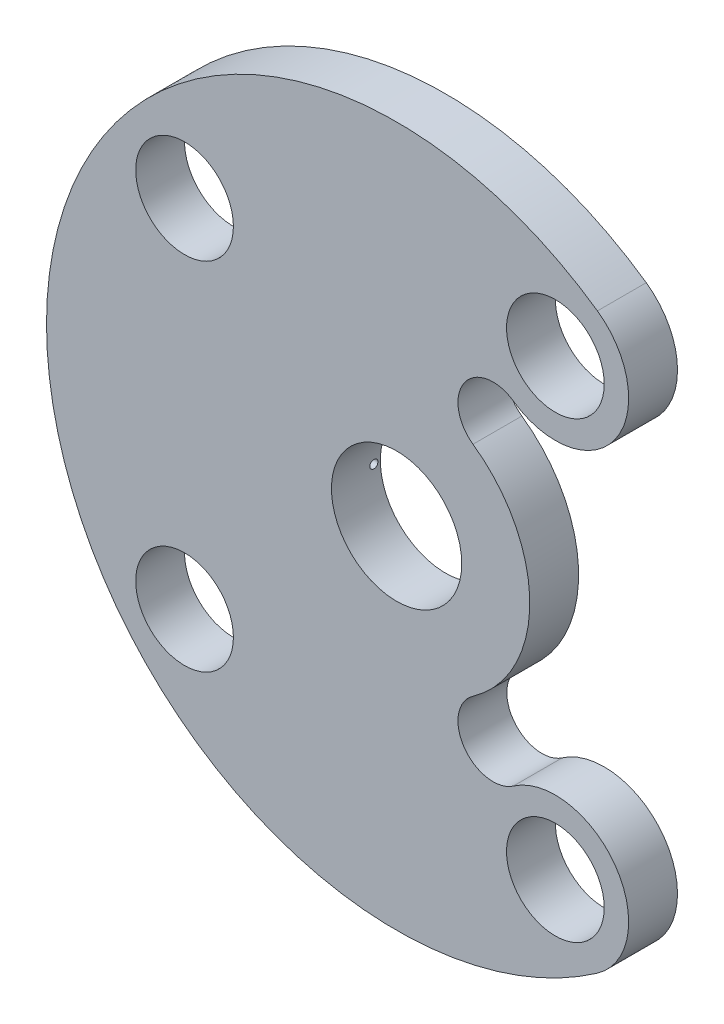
ISO-10303-21;
HEADER;
FILE_DESCRIPTION(('STEP AP214'),'2;1');
FILE_NAME('part.step','',(''),(''),'','','');
FILE_SCHEMA(('AUTOMOTIVE_DESIGN { 1 0 10303 214 1 1 1 1 }'));
ENDSEC;
DATA;
#1=APPLICATION_CONTEXT('core data for automotive mechanical design processes');
#2=APPLICATION_PROTOCOL_DEFINITION('international standard','automotive_design',2000,#1);
#3=PRODUCT_CONTEXT('',#1,'mechanical');
#4=PRODUCT('Part','Part','',(#3));
#5=PRODUCT_RELATED_PRODUCT_CATEGORY('part','',(#4));
#6=PRODUCT_DEFINITION_FORMATION('','',#4);
#7=PRODUCT_DEFINITION_CONTEXT('part definition',#1,'design');
#8=PRODUCT_DEFINITION('design','',#6,#7);
#9=PRODUCT_DEFINITION_SHAPE('','',#8);
#10=(LENGTH_UNIT() NAMED_UNIT(*) SI_UNIT(.MILLI.,.METRE.));
#11=(NAMED_UNIT(*) PLANE_ANGLE_UNIT() SI_UNIT($,.RADIAN.));
#12=(NAMED_UNIT(*) SI_UNIT($,.STERADIAN.) SOLID_ANGLE_UNIT());
#13=UNCERTAINTY_MEASURE_WITH_UNIT(LENGTH_MEASURE(1.E-05),#10,'distance_accuracy_value','');
#14=(GEOMETRIC_REPRESENTATION_CONTEXT(3) GLOBAL_UNCERTAINTY_ASSIGNED_CONTEXT((#13)) GLOBAL_UNIT_ASSIGNED_CONTEXT((#10,
#11,#12)) REPRESENTATION_CONTEXT('',''));
#15=CARTESIAN_POINT('',(0.,0.,0.));
#16=DIRECTION('',(0.,0.,1.));
#17=DIRECTION('',(1.,0.,0.));
#18=AXIS2_PLACEMENT_3D('',#15,#16,#17);
#19=CARTESIAN_POINT('',(9.7507994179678,-13.9255847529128,58.9206550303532));
#20=DIRECTION('',(0.,0.,-1.));
#21=DIRECTION('',(-1.,0.,0.));
#22=AXIS2_PLACEMENT_3D('',#19,#20,#21);
#23=CYLINDRICAL_SURFACE('',#22,3.);
#24=CARTESIAN_POINT('',(9.7507994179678,-13.9255847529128,0.));
#25=DIRECTION('',(0.,0.,1.));
#26=DIRECTION('',(1.,0.,0.));
#27=AXIS2_PLACEMENT_3D('',#24,#25,#26);
#28=CIRCLE('',#27,3.);
#29=CARTESIAN_POINT('',(12.7507994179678,-13.9255847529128,0.));
#30=VERTEX_POINT('',#29);
#31=EDGE_CURVE('E980',#30,#30,#28,.T.);
#32=ORIENTED_EDGE('',*,*,#31,.F.);
#33=EDGE_LOOP('',(#32));
#34=FACE_BOUND('',#33,.T.);
#35=CARTESIAN_POINT('',(9.7507994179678,-13.9255847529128,3.));
#36=DIRECTION('',(0.,0.,1.));
#37=DIRECTION('',(1.,0.,0.));
#38=AXIS2_PLACEMENT_3D('',#35,#36,#37);
#39=CIRCLE('',#38,3.);
#40=CARTESIAN_POINT('',(12.7507994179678,-13.9255847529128,3.));
#41=VERTEX_POINT('',#40);
#42=EDGE_CURVE('E947',#41,#41,#39,.T.);
#43=ORIENTED_EDGE('',*,*,#42,.T.);
#44=EDGE_LOOP('',(#43));
#45=FACE_BOUND('',#44,.T.);
#46=ADVANCED_FACE('F866',(#34,#45),#23,.F.);
#47=CARTESIAN_POINT('',(0.,0.,58.9206550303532));
#48=DIRECTION('',(0.,0.,-1.));
#49=DIRECTION('',(-1.,0.,0.));
#50=AXIS2_PLACEMENT_3D('',#47,#48,#49);
#51=CYLINDRICAL_SURFACE('',#50,4.);
#52=CARTESIAN_POINT('',(-4.,0.,0.647096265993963));
#53=CARTESIAN_POINT('',(-3.99999989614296,-0.0140279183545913,0.647095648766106));
#54=CARTESIAN_POINT('',(-3.99992541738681,-0.0280656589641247,0.645911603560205));
#55=CARTESIAN_POINT('',(-3.99963546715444,-0.0557535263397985,0.641205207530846));
#56=CARTESIAN_POINT('',(-3.99941983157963,-0.0694031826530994,0.637680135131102));
#57=CARTESIAN_POINT('',(-3.99887196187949,-0.0959098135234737,0.628393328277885));
#58=CARTESIAN_POINT('',(-3.99853978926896,-0.10876720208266,0.622632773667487));
#59=CARTESIAN_POINT('',(-3.99779620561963,-0.133329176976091,0.60904043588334));
#60=CARTESIAN_POINT('',(-3.99738481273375,-0.145034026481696,0.601209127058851));
#61=CARTESIAN_POINT('',(-3.99652834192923,-0.166979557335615,0.583684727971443));
#62=CARTESIAN_POINT('',(-3.99608322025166,-0.177218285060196,0.573989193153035));
#63=CARTESIAN_POINT('',(-3.99520983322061,-0.195924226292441,0.553016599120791));
#64=CARTESIAN_POINT('',(-3.99478156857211,-0.204391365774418,0.541739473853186));
#65=CARTESIAN_POINT('',(-3.99398985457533,-0.219319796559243,0.517912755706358));
#66=CARTESIAN_POINT('',(-3.99362645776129,-0.225779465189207,0.505362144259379));
#67=CARTESIAN_POINT('',(-3.99300602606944,-0.236499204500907,0.479351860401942));
#68=CARTESIAN_POINT('',(-3.99274899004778,-0.24075929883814,0.465892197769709));
#69=CARTESIAN_POINT('',(-3.99237068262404,-0.246953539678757,0.438464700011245));
#70=CARTESIAN_POINT('',(-3.9922492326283,-0.248890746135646,0.424497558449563));
#71=CARTESIAN_POINT('',(-3.99215525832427,-0.250393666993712,0.396435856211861));
#72=CARTESIAN_POINT('',(-3.99218273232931,-0.24995940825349,0.382341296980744));
#73=CARTESIAN_POINT('',(-3.9923833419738,-0.246734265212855,0.35444570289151));
#74=CARTESIAN_POINT('',(-3.9925562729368,-0.243946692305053,0.340644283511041));
#75=CARTESIAN_POINT('',(-3.99302798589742,-0.236099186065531,0.313705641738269));
#76=CARTESIAN_POINT('',(-3.9933267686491,-0.231039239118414,0.300568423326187));
#77=CARTESIAN_POINT('',(-3.99401674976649,-0.218786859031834,0.275320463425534));
#78=CARTESIAN_POINT('',(-3.99440801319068,-0.211592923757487,0.263210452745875));
#79=CARTESIAN_POINT('',(-3.99523879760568,-0.195277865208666,0.240368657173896));
#80=CARTESIAN_POINT('',(-3.99567831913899,-0.18615672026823,0.22963688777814));
#81=CARTESIAN_POINT('',(-3.99655699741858,-0.166227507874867,0.209836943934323));
#82=CARTESIAN_POINT('',(-3.99699615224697,-0.155416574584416,0.200771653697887));
#83=CARTESIAN_POINT('',(-3.99782388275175,-0.132424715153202,0.184584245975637));
#84=CARTESIAN_POINT('',(-3.99821245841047,-0.120243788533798,0.177462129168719));
#85=CARTESIAN_POINT('',(-3.99889527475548,-0.0948559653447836,0.165363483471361));
#86=CARTESIAN_POINT('',(-3.99918951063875,-0.0816490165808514,0.160387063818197));
#87=CARTESIAN_POINT('',(-3.99965042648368,-0.05458482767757,0.152723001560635));
#88=CARTESIAN_POINT('',(-3.99981710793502,-0.0407275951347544,0.15003533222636));
#89=CARTESIAN_POINT('',(-4.00000394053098,-0.0127812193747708,0.147028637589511));
#90=CARTESIAN_POINT('',(-4.00002433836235,0.00130749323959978,0.146705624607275));
#91=CARTESIAN_POINT('',(-3.9999169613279,0.029338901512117,0.148426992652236));
#92=CARTESIAN_POINT('',(-3.99978918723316,0.043281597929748,0.150471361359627));
#93=CARTESIAN_POINT('',(-3.9994000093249,0.0706139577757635,0.156866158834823));
#94=CARTESIAN_POINT('',(-3.99913871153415,0.0840040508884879,0.161214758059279));
#95=CARTESIAN_POINT('',(-3.9985118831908,0.109864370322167,0.172092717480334));
#96=CARTESIAN_POINT('',(-3.99814635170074,0.122334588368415,0.178622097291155));
#97=CARTESIAN_POINT('',(-3.99735151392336,0.146019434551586,0.193686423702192));
#98=CARTESIAN_POINT('',(-3.99692212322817,0.15723236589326,0.202224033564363));
#99=CARTESIAN_POINT('',(-3.99604817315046,0.178067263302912,0.221058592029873));
#100=CARTESIAN_POINT('',(-3.99560361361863,0.187689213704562,0.231355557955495));
#101=CARTESIAN_POINT('',(-3.99474871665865,0.205082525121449,0.25343373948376));
#102=CARTESIAN_POINT('',(-3.99433842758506,0.212851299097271,0.265216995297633));
#103=CARTESIAN_POINT('',(-3.99359911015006,0.226300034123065,0.289923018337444));
#104=CARTESIAN_POINT('',(-3.99327008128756,0.231980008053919,0.302845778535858));
#105=CARTESIAN_POINT('',(-3.99273073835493,0.241085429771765,0.329454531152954));
#106=CARTESIAN_POINT('',(-3.99252033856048,0.244512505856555,0.343139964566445));
#107=CARTESIAN_POINT('',(-3.99224174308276,0.249020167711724,0.370893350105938));
#108=CARTESIAN_POINT('',(-3.99217354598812,0.250100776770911,0.384961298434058));
#109=CARTESIAN_POINT('',(-3.99218708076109,0.249884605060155,0.413054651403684));
#110=CARTESIAN_POINT('',(-3.99226855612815,0.248591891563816,0.427080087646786));
#111=CARTESIAN_POINT('',(-3.99257171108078,0.243674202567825,0.454714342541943));
#112=CARTESIAN_POINT('',(-3.99279339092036,0.24004922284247,0.468323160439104));
#113=CARTESIAN_POINT('',(-3.99335191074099,0.230570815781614,0.494738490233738));
#114=CARTESIAN_POINT('',(-3.99368874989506,0.224717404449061,0.507545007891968));
#115=CARTESIAN_POINT('',(-3.99443962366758,0.210948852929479,0.531994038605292));
#116=CARTESIAN_POINT('',(-3.99485365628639,0.203033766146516,0.543636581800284));
#117=CARTESIAN_POINT('',(-3.99571308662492,0.185351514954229,0.565447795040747));
#118=CARTESIAN_POINT('',(-3.99615853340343,0.175581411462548,0.575614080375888));
#119=CARTESIAN_POINT('',(-3.997030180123,0.154470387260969,0.594165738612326));
#120=CARTESIAN_POINT('',(-3.99745637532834,0.143129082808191,0.602550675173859));
#121=CARTESIAN_POINT('',(-3.99824193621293,0.119184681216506,0.617307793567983));
#122=CARTESIAN_POINT('',(-3.99860121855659,0.106580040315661,0.623677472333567));
#123=CARTESIAN_POINT('',(-3.9992113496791,0.0804871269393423,0.634202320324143));
#124=CARTESIAN_POINT('',(-3.99946232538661,0.0669999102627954,0.63836008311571));
#125=CARTESIAN_POINT('',(-3.99976179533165,0.0445251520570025,0.643262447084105));
#126=CARTESIAN_POINT('',(-3.99985072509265,0.0356828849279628,0.644698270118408));
#127=CARTESIAN_POINT('',(-3.99996986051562,0.0178950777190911,0.646615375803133));
#128=CARTESIAN_POINT('',(-4.00000006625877,0.00894953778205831,0.647096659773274));
#129=CARTESIAN_POINT('',(-4.,0.,0.647096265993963));
#130=B_SPLINE_CURVE_WITH_KNOTS('',3,(#52,#53,#54,#55,#56,#57,#58,#59,#60,#61,#62,#63,#64,#65,
#66,#67,#68,#69,#70,#71,#72,#73,#74,#75,#76,#77,#78,#79,#80,#81,#82,#83,#84,#85,#86,#87,#88,#89,
#90,#91,#92,#93,#94,#95,#96,#97,#98,#99,#100,#101,#102,#103,#104,#105,#106,#107,#108,#109,#110,
#111,#112,#113,#114,#115,#116,#117,#118,#119,#120,#121,#122,#123,#124,#125,#126,#127,#128,#129),
.UNSPECIFIED.,.T.,.F.,(4,2,2,2,2,2,2,2,2,2,2,2,2,2,2,2,2,2,2,2,2,2,2,2,2,2,2,2,2,2,2,2,2,2,2,2,
2,2,4),(0.,0.0420510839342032,0.0841511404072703,0.12622900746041,0.168297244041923,
0.210421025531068,0.252546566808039,0.294706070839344,0.336865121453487,0.378968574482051,
0.42107155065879,0.463115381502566,0.505159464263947,0.547233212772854,0.589307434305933,
0.631453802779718,0.673600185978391,0.715748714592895,0.757896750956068,0.79997369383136,
0.842050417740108,0.884093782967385,0.926137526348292,0.968237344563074,1.01033757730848,
1.05249624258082,1.09465464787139,1.13678254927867,1.17891003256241,1.22096538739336,
1.2630208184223,1.30507594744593,1.34712998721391,1.38925122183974,1.43138276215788,
1.47356642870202,1.51570052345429,1.54252833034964,1.56935610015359),.UNSPECIFIED.);
#131=CARTESIAN_POINT('',(-4.,0.,0.647096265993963));
#132=VERTEX_POINT('',#131);
#133=EDGE_CURVE('E931',#132,#132,#130,.T.);
#134=ORIENTED_EDGE('',*,*,#133,.F.);
#135=EDGE_LOOP('',(#134));
#136=FACE_BOUND('',#135,.T.);
#137=CARTESIAN_POINT('',(0.,0.,0.));
#138=DIRECTION('',(0.,0.,1.));
#139=DIRECTION('',(1.,0.,0.));
#140=AXIS2_PLACEMENT_3D('',#137,#138,#139);
#141=CIRCLE('',#140,4.);
#142=CARTESIAN_POINT('',(4.,0.,0.));
#143=VERTEX_POINT('',#142);
#144=EDGE_CURVE('E986',#143,#143,#141,.T.);
#145=ORIENTED_EDGE('',*,*,#144,.F.);
#146=EDGE_LOOP('',(#145));
#147=FACE_BOUND('',#146,.T.);
#148=CARTESIAN_POINT('',(0.,0.,3.));
#149=DIRECTION('',(0.,0.,1.));
#150=DIRECTION('',(1.,0.,0.));
#151=AXIS2_PLACEMENT_3D('',#148,#149,#150);
#152=CIRCLE('',#151,4.);
#153=CARTESIAN_POINT('',(4.,0.,3.));
#154=VERTEX_POINT('',#153);
#155=EDGE_CURVE('E953',#154,#154,#152,.T.);
#156=ORIENTED_EDGE('',*,*,#155,.T.);
#157=EDGE_LOOP('',(#156));
#158=FACE_BOUND('',#157,.T.);
#159=ADVANCED_FACE('F1055',(#136,#147,#158),#51,.F.);
#160=CARTESIAN_POINT('',(9.7507994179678,-13.9255847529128,58.9206550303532));
#161=DIRECTION('',(0.,0.,-1.));
#162=DIRECTION('',(-1.,0.,0.));
#163=AXIS2_PLACEMENT_3D('',#160,#161,#162);
#164=CYLINDRICAL_SURFACE('',#163,4.5);
#165=CARTESIAN_POINT('',(9.7507994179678,-13.9255847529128,3.));
#166=DIRECTION('',(0.,0.,1.));
#167=DIRECTION('',(1.,0.,0.));
#168=AXIS2_PLACEMENT_3D('',#165,#166,#167);
#169=CIRCLE('',#168,4.5);
#170=CARTESIAN_POINT('',(12.3318933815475,-17.6117689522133,3.));
#171=VERTEX_POINT('',#170);
#172=CARTESIAN_POINT('',(7.16970545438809,-10.2394005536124,3.));
#173=VERTEX_POINT('',#172);
#174=EDGE_CURVE('E956',#171,#173,#169,.T.);
#175=ORIENTED_EDGE('',*,*,#174,.F.);
#176=DIRECTION('',(0.,0.,-1.));
#177=VECTOR('',#176,1.);
#178=CARTESIAN_POINT('',(12.3318933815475,-17.6117689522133,58.9206550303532));
#179=LINE('',#178,#177);
#180=CARTESIAN_POINT('',(12.3318933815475,-17.6117689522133,0.));
#181=VERTEX_POINT('',#180);
#182=EDGE_CURVE('E888',#171,#181,#179,.T.);
#183=ORIENTED_EDGE('',*,*,#182,.T.);
#184=CARTESIAN_POINT('',(9.7507994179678,-13.9255847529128,0.));
#185=DIRECTION('',(0.,0.,1.));
#186=DIRECTION('',(1.,0.,0.));
#187=AXIS2_PLACEMENT_3D('',#184,#185,#186);
#188=CIRCLE('',#187,4.5);
#189=CARTESIAN_POINT('',(7.16970545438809,-10.2394005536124,0.));
#190=VERTEX_POINT('',#189);
#191=EDGE_CURVE('E1003',#181,#190,#188,.T.);
#192=ORIENTED_EDGE('',*,*,#191,.T.);
#193=DIRECTION('',(0.,0.,-1.));
#194=VECTOR('',#193,1.);
#195=CARTESIAN_POINT('',(7.16970545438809,-10.2394005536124,58.9206550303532));
#196=LINE('',#195,#194);
#197=EDGE_CURVE('E1006',#173,#190,#196,.T.);
#198=ORIENTED_EDGE('',*,*,#197,.F.);
#199=EDGE_LOOP('',(#175,#183,#192,#198));
#200=FACE_BOUND('',#199,.T.);
#201=ADVANCED_FACE('F1029',(#200),#164,.T.);
#202=CARTESIAN_POINT('',(0.,0.,58.9206550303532));
#203=DIRECTION('',(0.,0.,-1.));
#204=DIRECTION('',(-1.,0.,0.));
#205=AXIS2_PLACEMENT_3D('',#202,#203,#204);
#206=CYLINDRICAL_SURFACE('',#205,21.5);
#207=CARTESIAN_POINT('',(0.,0.,3.));
#208=DIRECTION('',(0.,0.,1.));
#209=DIRECTION('',(1.,0.,0.));
#210=AXIS2_PLACEMENT_3D('',#207,#208,#209);
#211=CIRCLE('',#210,21.5);
#212=CARTESIAN_POINT('',(12.3318933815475,17.6117689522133,3.));
#213=VERTEX_POINT('',#212);
#214=EDGE_CURVE('E959',#213,#171,#211,.T.);
#215=ORIENTED_EDGE('',*,*,#214,.F.);
#216=DIRECTION('',(0.,0.,-1.));
#217=VECTOR('',#216,1.);
#218=CARTESIAN_POINT('',(12.3318933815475,17.6117689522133,58.9206550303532));
#219=LINE('',#218,#217);
#220=CARTESIAN_POINT('',(12.3318933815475,17.6117689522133,0.));
#221=VERTEX_POINT('',#220);
#222=EDGE_CURVE('E1009',#213,#221,#219,.T.);
#223=ORIENTED_EDGE('',*,*,#222,.T.);
#224=CARTESIAN_POINT('',(0.,0.,0.));
#225=DIRECTION('',(0.,0.,1.));
#226=DIRECTION('',(1.,0.,0.));
#227=AXIS2_PLACEMENT_3D('',#224,#225,#226);
#228=CIRCLE('',#227,21.5);
#229=EDGE_CURVE('E1001',#221,#181,#228,.T.);
#230=ORIENTED_EDGE('',*,*,#229,.T.);
#231=ORIENTED_EDGE('',*,*,#182,.F.);
#232=EDGE_LOOP('',(#215,#223,#230,#231));
#233=FACE_BOUND('',#232,.T.);
#234=ADVANCED_FACE('F1031',(#233),#206,.T.);
#235=CARTESIAN_POINT('',(9.7507994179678,13.9255847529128,58.9206550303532));
#236=DIRECTION('',(0.,0.,-1.));
#237=DIRECTION('',(-1.,0.,0.));
#238=AXIS2_PLACEMENT_3D('',#235,#236,#237);
#239=CYLINDRICAL_SURFACE('',#238,4.5);
#240=CARTESIAN_POINT('',(9.7507994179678,13.9255847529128,3.));
#241=DIRECTION('',(0.,0.,1.));
#242=DIRECTION('',(1.,0.,0.));
#243=AXIS2_PLACEMENT_3D('',#240,#241,#242);
#244=CIRCLE('',#243,4.5);
#245=CARTESIAN_POINT('',(7.16970545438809,10.2394005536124,3.));
#246=VERTEX_POINT('',#245);
#247=EDGE_CURVE('E962',#246,#213,#244,.T.);
#248=ORIENTED_EDGE('',*,*,#247,.F.);
#249=DIRECTION('',(0.,0.,-1.));
#250=VECTOR('',#249,1.);
#251=CARTESIAN_POINT('',(7.16970545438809,10.2394005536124,58.9206550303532));
#252=LINE('',#251,#250);
#253=CARTESIAN_POINT('',(7.16970545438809,10.2394005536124,0.));
#254=VERTEX_POINT('',#253);
#255=EDGE_CURVE('E1011',#246,#254,#252,.T.);
#256=ORIENTED_EDGE('',*,*,#255,.T.);
#257=CARTESIAN_POINT('',(9.7507994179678,13.9255847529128,0.));
#258=DIRECTION('',(0.,0.,1.));
#259=DIRECTION('',(1.,0.,0.));
#260=AXIS2_PLACEMENT_3D('',#257,#258,#259);
#261=CIRCLE('',#260,4.5);
#262=EDGE_CURVE('E998',#254,#221,#261,.T.);
#263=ORIENTED_EDGE('',*,*,#262,.T.);
#264=ORIENTED_EDGE('',*,*,#222,.F.);
#265=EDGE_LOOP('',(#248,#256,#263,#264));
#266=FACE_BOUND('',#265,.T.);
#267=ADVANCED_FACE('F1034',(#266),#239,.T.);
#268=CARTESIAN_POINT('',(5.93043012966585,8.46953196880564,58.9206550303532));
#269=DIRECTION('',(0.,0.,-1.));
#270=DIRECTION('',(-1.,0.,0.));
#271=AXIS2_PLACEMENT_3D('',#268,#269,#270);
#272=CYLINDRICAL_SURFACE('',#271,2.16061059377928);
#273=CARTESIAN_POINT('',(5.93043012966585,8.46953196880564,3.));
#274=DIRECTION('',(0.,0.,1.));
#275=DIRECTION('',(1.,0.,0.));
#276=AXIS2_PLACEMENT_3D('',#273,#274,#275);
#277=CIRCLE('',#276,2.16061059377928);
#278=CARTESIAN_POINT('',(4.69115480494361,6.69966338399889,3.));
#279=VERTEX_POINT('',#278);
#280=EDGE_CURVE('E965',#279,#246,#277,.F.);
#281=ORIENTED_EDGE('',*,*,#280,.F.);
#282=DIRECTION('',(0.,0.,-1.));
#283=VECTOR('',#282,1.);
#284=CARTESIAN_POINT('',(4.69115480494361,6.69966338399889,58.9206550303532));
#285=LINE('',#284,#283);
#286=CARTESIAN_POINT('',(4.69115480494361,6.69966338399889,0.));
#287=VERTEX_POINT('',#286);
#288=EDGE_CURVE('E1013',#279,#287,#285,.T.);
#289=ORIENTED_EDGE('',*,*,#288,.T.);
#290=CARTESIAN_POINT('',(5.93043012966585,8.46953196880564,0.));
#291=DIRECTION('',(0.,0.,-1.));
#292=DIRECTION('',(-1.,0.,0.));
#293=AXIS2_PLACEMENT_3D('',#290,#291,#292);
#294=CIRCLE('',#293,2.16061059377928);
#295=EDGE_CURVE('E995',#287,#254,#294,.T.);
#296=ORIENTED_EDGE('',*,*,#295,.T.);
#297=ORIENTED_EDGE('',*,*,#255,.F.);
#298=EDGE_LOOP('',(#281,#289,#296,#297));
#299=FACE_BOUND('',#298,.T.);
#300=ADVANCED_FACE('F1037',(#299),#272,.F.);
#301=CARTESIAN_POINT('',(0.,0.,58.9206550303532));
#302=DIRECTION('',(0.,0.,-1.));
#303=DIRECTION('',(-1.,0.,0.));
#304=AXIS2_PLACEMENT_3D('',#301,#302,#303);
#305=CYLINDRICAL_SURFACE('',#304,8.17877881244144);
#306=CARTESIAN_POINT('',(0.,0.,3.));
#307=DIRECTION('',(0.,0.,1.));
#308=DIRECTION('',(1.,0.,0.));
#309=AXIS2_PLACEMENT_3D('',#306,#307,#308);
#310=CIRCLE('',#309,8.17877881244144);
#311=CARTESIAN_POINT('',(4.69115480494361,-6.69966338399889,3.));
#312=VERTEX_POINT('',#311);
#313=EDGE_CURVE('E968',#312,#279,#310,.T.);
#314=ORIENTED_EDGE('',*,*,#313,.F.);
#315=DIRECTION('',(0.,0.,-1.));
#316=VECTOR('',#315,1.);
#317=CARTESIAN_POINT('',(4.69115480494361,-6.69966338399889,58.9206550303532));
#318=LINE('',#317,#316);
#319=CARTESIAN_POINT('',(4.69115480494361,-6.69966338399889,0.));
#320=VERTEX_POINT('',#319);
#321=EDGE_CURVE('E928',#312,#320,#318,.T.);
#322=ORIENTED_EDGE('',*,*,#321,.T.);
#323=CARTESIAN_POINT('',(0.,0.,0.));
#324=DIRECTION('',(0.,0.,1.));
#325=DIRECTION('',(1.,0.,0.));
#326=AXIS2_PLACEMENT_3D('',#323,#324,#325);
#327=CIRCLE('',#326,8.17877881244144);
#328=EDGE_CURVE('E992',#320,#287,#327,.T.);
#329=ORIENTED_EDGE('',*,*,#328,.T.);
#330=ORIENTED_EDGE('',*,*,#288,.F.);
#331=EDGE_LOOP('',(#314,#322,#329,#330));
#332=FACE_BOUND('',#331,.T.);
#333=ADVANCED_FACE('F1018',(#332),#305,.T.);
#334=CARTESIAN_POINT('',(5.93043012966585,-8.46953196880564,58.9206550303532));
#335=DIRECTION('',(0.,0.,-1.));
#336=DIRECTION('',(-1.,0.,0.));
#337=AXIS2_PLACEMENT_3D('',#334,#335,#336);
#338=CYLINDRICAL_SURFACE('',#337,2.16061059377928);
#339=CARTESIAN_POINT('',(5.93043012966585,-8.46953196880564,3.));
#340=DIRECTION('',(0.,0.,1.));
#341=DIRECTION('',(1.,0.,0.));
#342=AXIS2_PLACEMENT_3D('',#339,#340,#341);
#343=CIRCLE('',#342,2.16061059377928);
#344=EDGE_CURVE('E971',#173,#312,#343,.F.);
#345=ORIENTED_EDGE('',*,*,#344,.F.);
#346=ORIENTED_EDGE('',*,*,#197,.T.);
#347=CARTESIAN_POINT('',(5.93043012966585,-8.46953196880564,0.));
#348=DIRECTION('',(0.,0.,-1.));
#349=DIRECTION('',(1.,0.,0.));
#350=AXIS2_PLACEMENT_3D('',#347,#348,#349);
#351=CIRCLE('',#350,2.16061059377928);
#352=EDGE_CURVE('E989',#190,#320,#351,.T.);
#353=ORIENTED_EDGE('',*,*,#352,.T.);
#354=ORIENTED_EDGE('',*,*,#321,.F.);
#355=EDGE_LOOP('',(#345,#346,#353,#354));
#356=FACE_BOUND('',#355,.T.);
#357=ADVANCED_FACE('F868',(#356),#338,.F.);
#358=CARTESIAN_POINT('',(-13.0227555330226,-10.9273893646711,58.9206550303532));
#359=DIRECTION('',(0.,0.,-1.));
#360=DIRECTION('',(-1.,0.,0.));
#361=AXIS2_PLACEMENT_3D('',#358,#359,#360);
#362=CYLINDRICAL_SURFACE('',#361,3.);
#363=CARTESIAN_POINT('',(-13.0227555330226,-10.9273893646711,0.));
#364=DIRECTION('',(0.,0.,1.));
#365=DIRECTION('',(1.,0.,0.));
#366=AXIS2_PLACEMENT_3D('',#363,#364,#365);
#367=CIRCLE('',#366,3.);
#368=CARTESIAN_POINT('',(-10.0227555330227,-10.9273893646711,0.));
#369=VERTEX_POINT('',#368);
#370=EDGE_CURVE('E983',#369,#369,#367,.T.);
#371=ORIENTED_EDGE('',*,*,#370,.F.);
#372=EDGE_LOOP('',(#371));
#373=FACE_BOUND('',#372,.T.);
#374=CARTESIAN_POINT('',(-13.0227555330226,-10.9273893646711,3.));
#375=DIRECTION('',(0.,0.,1.));
#376=DIRECTION('',(1.,0.,0.));
#377=AXIS2_PLACEMENT_3D('',#374,#375,#376);
#378=CIRCLE('',#377,3.);
#379=CARTESIAN_POINT('',(-10.0227555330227,-10.9273893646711,3.));
#380=VERTEX_POINT('',#379);
#381=EDGE_CURVE('E950',#380,#380,#378,.T.);
#382=ORIENTED_EDGE('',*,*,#381,.T.);
#383=EDGE_LOOP('',(#382));
#384=FACE_BOUND('',#383,.T.);
#385=ADVANCED_FACE('F1068',(#373,#384),#362,.F.);
#386=CARTESIAN_POINT('',(-13.0227555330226,10.9273893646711,58.9206550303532));
#387=DIRECTION('',(0.,0.,-1.));
#388=DIRECTION('',(-1.,0.,0.));
#389=AXIS2_PLACEMENT_3D('',#386,#387,#388);
#390=CYLINDRICAL_SURFACE('',#389,3.);
#391=CARTESIAN_POINT('',(-13.0227555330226,10.9273893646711,0.));
#392=DIRECTION('',(0.,0.,1.));
#393=DIRECTION('',(1.,0.,0.));
#394=AXIS2_PLACEMENT_3D('',#391,#392,#393);
#395=CIRCLE('',#394,3.);
#396=CARTESIAN_POINT('',(-10.0227555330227,10.9273893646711,0.));
#397=VERTEX_POINT('',#396);
#398=EDGE_CURVE('E977',#397,#397,#395,.T.);
#399=ORIENTED_EDGE('',*,*,#398,.F.);
#400=EDGE_LOOP('',(#399));
#401=FACE_BOUND('',#400,.T.);
#402=CARTESIAN_POINT('',(-13.0227555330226,10.9273893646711,3.));
#403=DIRECTION('',(0.,0.,1.));
#404=DIRECTION('',(1.,0.,0.));
#405=AXIS2_PLACEMENT_3D('',#402,#403,#404);
#406=CIRCLE('',#405,3.);
#407=CARTESIAN_POINT('',(-10.0227555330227,10.9273893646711,3.));
#408=VERTEX_POINT('',#407);
#409=EDGE_CURVE('E934',#408,#408,#406,.T.);
#410=ORIENTED_EDGE('',*,*,#409,.T.);
#411=EDGE_LOOP('',(#410));
#412=FACE_BOUND('',#411,.T.);
#413=ADVANCED_FACE('F1067',(#401,#412),#390,.F.);
#414=CARTESIAN_POINT('',(7.84061477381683,-11.1975583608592,0.));
#415=DIRECTION('',(0.,0.,1.));
#416=DIRECTION('',(1.,0.,0.));
#417=AXIS2_PLACEMENT_3D('',#414,#415,#416);
#418=PLANE('',#417);
#419=CARTESIAN_POINT('',(-6.00000000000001,0.,0.));
#420=DIRECTION('',(0.,0.,1.));
#421=DIRECTION('',(-1.,0.,0.));
#422=AXIS2_PLACEMENT_3D('',#419,#420,#421);
#423=ELLIPSE('',#422,8.02275553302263,0.977727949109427);
#424=CARTESIAN_POINT('',(-6.,0.977727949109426,0.));
#425=VERTEX_POINT('',#424);
#426=CARTESIAN_POINT('',(-6.,-0.977727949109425,0.));
#427=VERTEX_POINT('',#426);
#428=EDGE_CURVE('E12',#425,#427,#423,.T.);
#429=ORIENTED_EDGE('',*,*,#428,.T.);
#430=DIRECTION('',(0.,1.,0.));
#431=VECTOR('',#430,1.);
#432=CARTESIAN_POINT('',(-6.,-11.1975583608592,0.));
#433=LINE('',#432,#431);
#434=EDGE_CURVE('E874',#427,#425,#433,.T.);
#435=ORIENTED_EDGE('',*,*,#434,.T.);
#436=EDGE_LOOP('',(#429,#435));
#437=FACE_BOUND('',#436,.T.);
#438=ORIENTED_EDGE('',*,*,#398,.T.);
#439=EDGE_LOOP('',(#438));
#440=FACE_BOUND('',#439,.T.);
#441=ORIENTED_EDGE('',*,*,#370,.T.);
#442=EDGE_LOOP('',(#441));
#443=FACE_BOUND('',#442,.T.);
#444=ORIENTED_EDGE('',*,*,#352,.F.);
#445=ORIENTED_EDGE('',*,*,#191,.F.);
#446=ORIENTED_EDGE('',*,*,#229,.F.);
#447=ORIENTED_EDGE('',*,*,#262,.F.);
#448=ORIENTED_EDGE('',*,*,#295,.F.);
#449=ORIENTED_EDGE('',*,*,#328,.F.);
#450=EDGE_LOOP('',(#444,#445,#446,#447,#448,#449));
#451=FACE_BOUND('',#450,.T.);
#452=ORIENTED_EDGE('',*,*,#144,.T.);
#453=EDGE_LOOP('',(#452));
#454=FACE_BOUND('',#453,.T.);
#455=ORIENTED_EDGE('',*,*,#31,.T.);
#456=EDGE_LOOP('',(#455));
#457=FACE_BOUND('',#456,.T.);
#458=CARTESIAN_POINT('',(9.7507994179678,13.9255847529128,0.));
#459=DIRECTION('',(0.,0.,1.));
#460=DIRECTION('',(1.,0.,0.));
#461=AXIS2_PLACEMENT_3D('',#458,#459,#460);
#462=CIRCLE('',#461,3.);
#463=CARTESIAN_POINT('',(12.7507994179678,13.9255847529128,0.));
#464=VERTEX_POINT('',#463);
#465=EDGE_CURVE('E974',#464,#464,#462,.T.);
#466=ORIENTED_EDGE('',*,*,#465,.T.);
#467=EDGE_LOOP('',(#466));
#468=FACE_BOUND('',#467,.T.);
#469=ADVANCED_FACE('F924',(#437,#440,#443,#451,#454,#457,#468),#418,.F.);
#470=CARTESIAN_POINT('',(9.7507994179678,13.9255847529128,58.9206550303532));
#471=DIRECTION('',(0.,0.,-1.));
#472=DIRECTION('',(-1.,0.,0.));
#473=AXIS2_PLACEMENT_3D('',#470,#471,#472);
#474=CYLINDRICAL_SURFACE('',#473,3.);
#475=ORIENTED_EDGE('',*,*,#465,.F.);
#476=EDGE_LOOP('',(#475));
#477=FACE_BOUND('',#476,.T.);
#478=CARTESIAN_POINT('',(9.7507994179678,13.9255847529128,3.));
#479=DIRECTION('',(0.,0.,1.));
#480=DIRECTION('',(1.,0.,0.));
#481=AXIS2_PLACEMENT_3D('',#478,#479,#480);
#482=CIRCLE('',#481,3.);
#483=CARTESIAN_POINT('',(12.7507994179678,13.9255847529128,3.));
#484=VERTEX_POINT('',#483);
#485=EDGE_CURVE('E930',#484,#484,#482,.T.);
#486=ORIENTED_EDGE('',*,*,#485,.T.);
#487=EDGE_LOOP('',(#486));
#488=FACE_BOUND('',#487,.T.);
#489=ADVANCED_FACE('F1041',(#477,#488),#474,.F.);
#490=CARTESIAN_POINT('',(0.,20.,3.00000000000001));
#491=DIRECTION('',(0.,0.,1.));
#492=DIRECTION('',(1.,0.,0.));
#493=AXIS2_PLACEMENT_3D('',#490,#491,#492);
#494=PLANE('',#493);
#495=ORIENTED_EDGE('',*,*,#485,.F.);
#496=EDGE_LOOP('',(#495));
#497=FACE_BOUND('',#496,.T.);
#498=ORIENTED_EDGE('',*,*,#409,.F.);
#499=EDGE_LOOP('',(#498));
#500=FACE_BOUND('',#499,.T.);
#501=ORIENTED_EDGE('',*,*,#42,.F.);
#502=EDGE_LOOP('',(#501));
#503=FACE_BOUND('',#502,.T.);
#504=ORIENTED_EDGE('',*,*,#381,.F.);
#505=EDGE_LOOP('',(#504));
#506=FACE_BOUND('',#505,.T.);
#507=ORIENTED_EDGE('',*,*,#155,.F.);
#508=EDGE_LOOP('',(#507));
#509=FACE_BOUND('',#508,.T.);
#510=ORIENTED_EDGE('',*,*,#174,.T.);
#511=ORIENTED_EDGE('',*,*,#344,.T.);
#512=ORIENTED_EDGE('',*,*,#313,.T.);
#513=ORIENTED_EDGE('',*,*,#280,.T.);
#514=ORIENTED_EDGE('',*,*,#247,.T.);
#515=ORIENTED_EDGE('',*,*,#214,.T.);
#516=EDGE_LOOP('',(#510,#511,#512,#513,#514,#515));
#517=FACE_BOUND('',#516,.T.);
#518=ADVANCED_FACE('F1039',(#497,#500,#503,#506,#509,#517),#494,.T.);
#519=CARTESIAN_POINT('',(-24.229791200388,0.,-2.23833690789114));
#520=DIRECTION('',(-0.992546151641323,0.,-0.121869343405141));
#521=DIRECTION('',(-0.121869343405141,0.,0.992546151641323));
#522=AXIS2_PLACEMENT_3D('',#519,#520,#521);
#523=CYLINDRICAL_SURFACE('',#522,0.977727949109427);
#524=ORIENTED_EDGE('',*,*,#428,.F.);
#525=CARTESIAN_POINT('',(-6.,0.,0.));
#526=DIRECTION('',(-0.992546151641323,0.,-0.121869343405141));
#527=DIRECTION('',(-0.121869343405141,0.,0.992546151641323));
#528=AXIS2_PLACEMENT_3D('',#525,#526,#527);
#529=CIRCLE('',#528,0.977727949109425);
#530=EDGE_CURVE('E880',#427,#425,#529,.T.);
#531=ORIENTED_EDGE('',*,*,#530,.F.);
#532=EDGE_LOOP('',(#524,#531));
#533=FACE_BOUND('',#532,.T.);
#534=ADVANCED_FACE('F929',(#533),#523,.F.);
#535=CARTESIAN_POINT('',(-6.11915506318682,0.,0.970440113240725));
#536=DIRECTION('',(0.992546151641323,0.,0.121869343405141));
#537=DIRECTION('',(0.121869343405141,0.,-0.992546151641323));
#538=AXIS2_PLACEMENT_3D('',#535,#536,#537);
#539=PLANE('',#538);
#540=CARTESIAN_POINT('',(-6.04875729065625,0.,0.397096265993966));
#541=DIRECTION('',(0.992546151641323,0.,0.121869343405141));
#542=DIRECTION('',(0.121869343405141,0.,-0.992546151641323));
#543=AXIS2_PLACEMENT_3D('',#540,#541,#542);
#544=ELLIPSE('',#543,0.251877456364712,0.25);
#545=CARTESIAN_POINT('',(-6.01806115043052,0.,0.147096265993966));
#546=VERTEX_POINT('',#545);
#547=EDGE_CURVE('E937',#546,#546,#544,.F.);
#548=ORIENTED_EDGE('',*,*,#547,.F.);
#549=EDGE_LOOP('',(#548));
#550=FACE_BOUND('',#549,.T.);
#551=ORIENTED_EDGE('',*,*,#530,.T.);
#552=ORIENTED_EDGE('',*,*,#434,.F.);
#553=EDGE_LOOP('',(#551,#552));
#554=FACE_BOUND('',#553,.T.);
#555=ADVANCED_FACE('F927',(#550,#554),#539,.F.);
#556=CARTESIAN_POINT('',(-6.75851919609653,0.,0.397096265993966));
#557=DIRECTION('',(1.,0.,0.));
#558=DIRECTION('',(0.,0.,-1.));
#559=AXIS2_PLACEMENT_3D('',#556,#557,#558);
#560=CYLINDRICAL_SURFACE('',#559,0.25);
#561=ORIENTED_EDGE('',*,*,#133,.T.);
#562=EDGE_LOOP('',(#561));
#563=FACE_BOUND('',#562,.T.);
#564=ORIENTED_EDGE('',*,*,#547,.T.);
#565=EDGE_LOOP('',(#564));
#566=FACE_BOUND('',#565,.T.);
#567=ADVANCED_FACE('F1116',(#563,#566),#560,.F.);
#568=CLOSED_SHELL('',(#46,#159,#201,#234,#267,#300,#333,#357,#385,#413,#469,#489,#518,#534,#555,#567));
#569=MANIFOLD_SOLID_BREP('B2',#568);
#570=ADVANCED_BREP_SHAPE_REPRESENTATION('',(#18,#569),#14);
#571=SHAPE_DEFINITION_REPRESENTATION(#9,#570);
ENDSEC;
END-ISO-10303-21;
